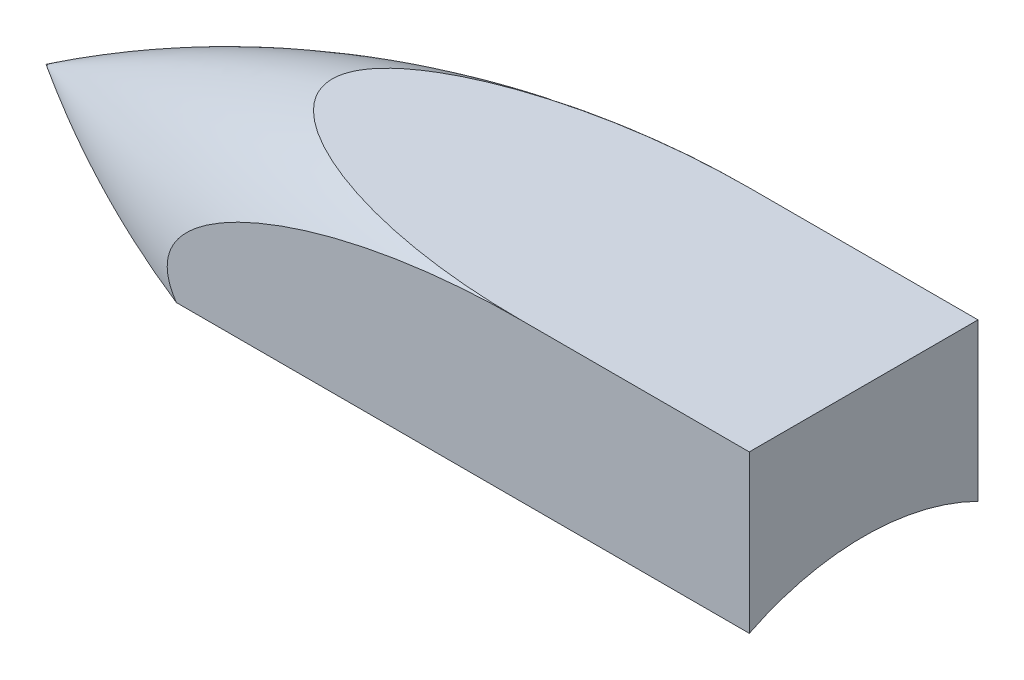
ISO-10303-21;
HEADER;
FILE_DESCRIPTION(('STEP AP214'),'2;1');
FILE_NAME('part.step','',(''),(''),'','','');
FILE_SCHEMA(('AUTOMOTIVE_DESIGN { 1 0 10303 214 1 1 1 1 }'));
ENDSEC;
DATA;
#1=APPLICATION_CONTEXT('core data for automotive mechanical design processes');
#2=APPLICATION_PROTOCOL_DEFINITION('international standard','automotive_design',2000,#1);
#3=PRODUCT_CONTEXT('',#1,'mechanical');
#4=PRODUCT('Part','Part','',(#3));
#5=PRODUCT_RELATED_PRODUCT_CATEGORY('part','',(#4));
#6=PRODUCT_DEFINITION_FORMATION('','',#4);
#7=PRODUCT_DEFINITION_CONTEXT('part definition',#1,'design');
#8=PRODUCT_DEFINITION('design','',#6,#7);
#9=PRODUCT_DEFINITION_SHAPE('','',#8);
#10=(LENGTH_UNIT() NAMED_UNIT(*) SI_UNIT(.MILLI.,.METRE.));
#11=(NAMED_UNIT(*) PLANE_ANGLE_UNIT() SI_UNIT($,.RADIAN.));
#12=(NAMED_UNIT(*) SI_UNIT($,.STERADIAN.) SOLID_ANGLE_UNIT());
#13=UNCERTAINTY_MEASURE_WITH_UNIT(LENGTH_MEASURE(1.E-05),#10,'distance_accuracy_value','');
#14=(GEOMETRIC_REPRESENTATION_CONTEXT(3) GLOBAL_UNCERTAINTY_ASSIGNED_CONTEXT((#13)) GLOBAL_UNIT_ASSIGNED_CONTEXT((#10,
#11,#12)) REPRESENTATION_CONTEXT('',''));
#15=CARTESIAN_POINT('',(0.,0.,0.));
#16=DIRECTION('',(0.,0.,1.));
#17=DIRECTION('',(1.,0.,0.));
#18=AXIS2_PLACEMENT_3D('',#15,#16,#17);
#19=CARTESIAN_POINT('',(25.4,0.,0.));
#20=DIRECTION('',(1.,0.,0.));
#21=DIRECTION('',(0.,0.,-1.));
#22=AXIS2_PLACEMENT_3D('',#19,#20,#21);
#23=PLANE('',#22);
#24=DIRECTION('',(0.,-1.,0.));
#25=VECTOR('',#24,1.);
#26=CARTESIAN_POINT('',(25.4,0.0451908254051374,-12.7));
#27=LINE('',#26,#25);
#28=CARTESIAN_POINT('',(25.4,14.478,-12.7));
#29=VERTEX_POINT('',#28);
#30=CARTESIAN_POINT('',(25.4,-2.9773316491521,-12.7));
#31=VERTEX_POINT('',#30);
#32=EDGE_CURVE('E108',#29,#31,#27,.T.);
#33=ORIENTED_EDGE('',*,*,#32,.F.);
#34=DIRECTION('',(0.,0.,1.));
#35=VECTOR('',#34,1.);
#36=CARTESIAN_POINT('',(25.4,14.478,-42.5605835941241));
#37=LINE('',#36,#35);
#38=CARTESIAN_POINT('',(25.4,14.478,12.7));
#39=VERTEX_POINT('',#38);
#40=EDGE_CURVE('E95',#29,#39,#37,.T.);
#41=ORIENTED_EDGE('',*,*,#40,.T.);
#42=DIRECTION('',(0.,-1.,0.));
#43=VECTOR('',#42,1.);
#44=CARTESIAN_POINT('',(25.4,0.0451908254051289,12.7));
#45=LINE('',#44,#43);
#46=CARTESIAN_POINT('',(25.4,-2.97733164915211,12.7));
#47=VERTEX_POINT('',#46);
#48=EDGE_CURVE('E106',#39,#47,#45,.T.);
#49=ORIENTED_EDGE('',*,*,#48,.T.);
#50=CARTESIAN_POINT('',(25.4,-28.575,0.));
#51=DIRECTION('',(1.,0.,0.));
#52=DIRECTION('',(0.,0.,-1.));
#53=AXIS2_PLACEMENT_3D('',#50,#51,#52);
#54=CIRCLE('',#53,28.575);
#55=EDGE_CURVE('E112',#31,#47,#54,.T.);
#56=ORIENTED_EDGE('',*,*,#55,.F.);
#57=EDGE_LOOP('',(#33,#41,#49,#56));
#58=FACE_BOUND('',#57,.T.);
#59=ADVANCED_FACE('F49',(#58),#23,.T.);
#60=CARTESIAN_POINT('',(0.,-101.446850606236,0.));
#61=DIRECTION('',(0.,0.,-1.));
#62=DIRECTION('',(0.,1.,0.));
#63=AXIS2_PLACEMENT_3D('',#60,#61,#62);
#64=CIRCLE('',#63,120.705679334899);
#65=TRIMMED_CURVE('',#64,(PARAMETER_VALUE(-0.57268684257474)),
(PARAMETER_VALUE(0.57268684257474)),.T.,.PARAMETER.);
#66=CARTESIAN_POINT('',(0.,0.,0.));
#67=DIRECTION('',(1.,0.,0.));
#68=AXIS1_PLACEMENT('',#66,#67);
#69=SURFACE_OF_REVOLUTION('',#65,#68);
#70=CARTESIAN_POINT('',(-33.5600579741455,6.99635018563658,12.7));
#71=CARTESIAN_POINT('',(-33.2930167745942,7.15653951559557,12.7));
#72=CARTESIAN_POINT('',(-33.0232036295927,7.31211219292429,12.7));
#73=CARTESIAN_POINT('',(-32.4789356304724,7.61493459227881,12.7));
#74=CARTESIAN_POINT('',(-32.2044803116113,7.76218347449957,12.7));
#75=CARTESIAN_POINT('',(-31.3750239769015,8.1927048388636,12.7));
#76=CARTESIAN_POINT('',(-30.8141177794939,8.46464268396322,12.7));
#77=CARTESIAN_POINT('',(-29.679703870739,8.98323875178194,12.7));
#78=CARTESIAN_POINT('',(-29.1061761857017,9.22985279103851,12.7));
#79=CARTESIAN_POINT('',(-27.9500538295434,9.70043063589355,12.7));
#80=CARTESIAN_POINT('',(-27.3674607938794,9.92439847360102,12.7));
#81=CARTESIAN_POINT('',(-26.1902365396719,10.3537567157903,12.7));
#82=CARTESIAN_POINT('',(-25.5955463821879,10.5589848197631,12.7));
#83=CARTESIAN_POINT('',(-24.3999953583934,10.9506016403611,12.7));
#84=CARTESIAN_POINT('',(-23.7991343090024,11.1369897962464,12.7));
#85=CARTESIAN_POINT('',(-22.5928017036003,11.4920966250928,12.7));
#86=CARTESIAN_POINT('',(-21.9873346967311,11.6608307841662,12.7));
#87=CARTESIAN_POINT('',(-20.7720418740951,11.9818362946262,12.7));
#88=CARTESIAN_POINT('',(-20.1622158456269,12.1341068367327,12.7));
#89=CARTESIAN_POINT('',(-18.4028599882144,12.5495781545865,12.7));
#90=CARTESIAN_POINT('',(-17.2486303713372,12.7930711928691,12.7));
#91=CARTESIAN_POINT('',(-14.9304626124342,13.228751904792,12.7));
#92=CARTESIAN_POINT('',(-13.7665230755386,13.4209320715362,12.7));
#93=CARTESIAN_POINT('',(-11.4305728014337,13.7564963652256,12.7));
#94=CARTESIAN_POINT('',(-10.2585557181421,13.8998362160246,12.7));
#95=CARTESIAN_POINT('',(-7.90977060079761,14.1390237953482,12.7));
#96=CARTESIAN_POINT('',(-6.73300281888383,14.2348740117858,12.7));
#97=CARTESIAN_POINT('',(-4.37972435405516,14.3798332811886,12.7));
#98=CARTESIAN_POINT('',(-3.20322121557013,14.4290652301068,12.7));
#99=CARTESIAN_POINT('',(-0.849156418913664,14.4816729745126,12.7));
#100=CARTESIAN_POINT('',(0.328405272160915,14.485047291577,12.7));
#101=CARTESIAN_POINT('',(2.68202259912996,14.4459786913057,12.7));
#102=CARTESIAN_POINT('',(3.85807871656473,14.4035649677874,12.7));
#103=CARTESIAN_POINT('',(6.20752309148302,14.2725880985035,12.7));
#104=CARTESIAN_POINT('',(7.3809115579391,14.1840287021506,12.7));
#105=CARTESIAN_POINT('',(9.9168113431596,13.941402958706,12.7));
#106=CARTESIAN_POINT('',(11.2785270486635,13.7789288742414,12.7));
#107=CARTESIAN_POINT('',(13.9926333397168,13.3878436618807,12.7));
#108=CARTESIAN_POINT('',(15.3450233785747,13.159228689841,12.7));
#109=CARTESIAN_POINT('',(17.3611402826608,12.764143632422,12.7));
#110=CARTESIAN_POINT('',(18.0301023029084,12.6240051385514,12.7));
#111=CARTESIAN_POINT('',(19.3639515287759,12.3255667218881,12.7));
#112=CARTESIAN_POINT('',(20.0288389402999,12.167267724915,12.7));
#113=CARTESIAN_POINT('',(21.353606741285,11.8316364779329,12.7));
#114=CARTESIAN_POINT('',(22.0134884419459,11.6543094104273,12.7));
#115=CARTESIAN_POINT('',(23.3274366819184,11.2793952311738,12.7));
#116=CARTESIAN_POINT('',(23.9815036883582,11.0818097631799,12.7));
#117=CARTESIAN_POINT('',(25.1964712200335,10.6923881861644,12.7));
#118=CARTESIAN_POINT('',(25.7582377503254,10.5032565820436,12.7));
#119=CARTESIAN_POINT('',(26.8754756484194,10.107143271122,12.7));
#120=CARTESIAN_POINT('',(27.4309469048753,9.90016124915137,12.7));
#121=CARTESIAN_POINT('',(28.5366108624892,9.46558365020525,12.7));
#122=CARTESIAN_POINT('',(29.0867698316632,9.23790183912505,12.7));
#123=CARTESIAN_POINT('',(30.1772339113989,8.76026723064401,12.7));
#124=CARTESIAN_POINT('',(30.7175410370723,8.51031905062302,12.7));
#125=CARTESIAN_POINT('',(31.7917862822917,7.98165041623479,12.7));
#126=CARTESIAN_POINT('',(32.3255795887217,7.70263199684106,12.7));
#127=CARTESIAN_POINT('',(33.1133475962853,7.26040067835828,12.7));
#128=CARTESIAN_POINT('',(33.3739398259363,7.10893899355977,12.7));
#129=CARTESIAN_POINT('',(33.8898343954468,6.79728118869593,12.7));
#130=CARTESIAN_POINT('',(34.1451373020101,6.63708601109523,12.7));
#131=CARTESIAN_POINT('',(34.6478618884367,6.30791969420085,12.7));
#132=CARTESIAN_POINT('',(34.8953216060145,6.13900684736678,12.7));
#133=CARTESIAN_POINT('',(35.382536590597,5.79026129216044,12.7));
#134=CARTESIAN_POINT('',(35.6222903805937,5.61042650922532,12.7));
#135=CARTESIAN_POINT('',(36.0915424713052,5.23876048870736,12.7));
#136=CARTESIAN_POINT('',(36.3210612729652,5.04695526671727,12.7));
#137=CARTESIAN_POINT('',(36.767507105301,4.64930288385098,12.7));
#138=CARTESIAN_POINT('',(36.9844412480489,4.44346379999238,12.7));
#139=CARTESIAN_POINT('',(37.3331052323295,4.08605089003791,12.7));
#140=CARTESIAN_POINT('',(37.4693792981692,3.93891364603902,12.7));
#141=CARTESIAN_POINT('',(37.7328925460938,3.63667146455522,12.7));
#142=CARTESIAN_POINT('',(37.8601303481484,3.48156531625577,12.7));
#143=CARTESIAN_POINT('',(38.1032716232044,3.16306344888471,12.7));
#144=CARTESIAN_POINT('',(38.219194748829,2.99968287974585,12.7));
#145=CARTESIAN_POINT('',(38.4373094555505,2.66409719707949,12.7));
#146=CARTESIAN_POINT('',(38.5395069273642,2.49189591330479,12.7));
#147=CARTESIAN_POINT('',(38.7637660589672,2.06935036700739,12.7));
#148=CARTESIAN_POINT('',(38.8780557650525,1.81469847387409,12.7));
#149=CARTESIAN_POINT('',(39.0178818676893,1.42170059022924,12.7));
#150=CARTESIAN_POINT('',(39.0592211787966,1.28887173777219,12.7));
#151=CARTESIAN_POINT('',(39.1302740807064,1.02016449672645,12.7));
#152=CARTESIAN_POINT('',(39.1599935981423,0.884287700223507,12.7));
#153=CARTESIAN_POINT('',(39.2070937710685,0.609104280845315,12.7));
#154=CARTESIAN_POINT('',(39.2243577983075,0.469777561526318,12.7));
#155=CARTESIAN_POINT('',(39.2454893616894,0.190105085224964,12.7));
#156=CARTESIAN_POINT('',(39.2493571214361,0.0497593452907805,12.7));
#157=CARTESIAN_POINT('',(39.2435466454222,-0.230663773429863,12.7));
#158=CARTESIAN_POINT('',(39.2338675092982,-0.37074113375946,12.7));
#159=CARTESIAN_POINT('',(39.2013369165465,-0.649317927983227,12.7));
#160=CARTESIAN_POINT('',(39.1784856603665,-0.787817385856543,12.7));
#161=CARTESIAN_POINT('',(39.0978311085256,-1.16834741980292,12.7));
#162=CARTESIAN_POINT('',(39.0266642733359,-1.4076215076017,12.7));
#163=CARTESIAN_POINT('',(38.851564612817,-1.87359120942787,12.7));
#164=CARTESIAN_POINT('',(38.7476160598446,-2.10028072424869,12.7));
#165=CARTESIAN_POINT('',(38.5273403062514,-2.51436538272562,12.7));
#166=CARTESIAN_POINT('',(38.4138166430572,-2.70327953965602,12.7));
#167=CARTESIAN_POINT('',(38.1705373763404,-3.07043941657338,12.7));
#168=CARTESIAN_POINT('',(38.0407701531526,-3.24867736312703,12.7));
#169=CARTESIAN_POINT('',(37.7680265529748,-3.59543651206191,12.7));
#170=CARTESIAN_POINT('',(37.6250151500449,-3.76392991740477,12.7));
#171=CARTESIAN_POINT('',(37.3286139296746,-4.09158975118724,12.7));
#172=CARTESIAN_POINT('',(37.1752197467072,-4.25075220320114,12.7));
#173=CARTESIAN_POINT('',(36.8550179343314,-4.56554425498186,12.7));
#174=CARTESIAN_POINT('',(36.6879373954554,-4.7208949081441,12.7));
#175=CARTESIAN_POINT('',(36.3465804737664,-5.02338342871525,12.7));
#176=CARTESIAN_POINT('',(36.1723049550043,-5.17052227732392,12.7));
#177=CARTESIAN_POINT('',(35.6402511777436,-5.60119592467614,12.7));
#178=CARTESIAN_POINT('',(35.2735360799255,-5.87371011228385,12.7));
#179=CARTESIAN_POINT('',(34.5226892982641,-6.39508342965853,12.7));
#180=CARTESIAN_POINT('',(34.1385203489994,-6.64388805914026,12.7));
#181=CARTESIAN_POINT('',(33.5530658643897,-7.00169111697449,12.7));
#182=CARTESIAN_POINT('',(33.3564201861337,-7.11837019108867,12.7));
#183=CARTESIAN_POINT('',(32.9603913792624,-7.34700209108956,12.7));
#184=CARTESIAN_POINT('',(32.7610081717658,-7.45895478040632,12.7));
#185=CARTESIAN_POINT('',(32.2476759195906,-7.73985309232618,12.7));
#186=CARTESIAN_POINT('',(31.9320081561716,-7.9056620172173,12.7));
#187=CARTESIAN_POINT('',(31.2958008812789,-8.22767859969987,12.7));
#188=CARTESIAN_POINT('',(30.97526088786,-8.38388529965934,12.7));
#189=CARTESIAN_POINT('',(30.0072750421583,-8.83951823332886,12.7));
#190=CARTESIAN_POINT('',(29.3536445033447,-9.12585973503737,12.7));
#191=CARTESIAN_POINT('',(28.0331398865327,-9.66915199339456,12.7));
#192=CARTESIAN_POINT('',(27.3662454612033,-9.92605272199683,12.7));
#193=CARTESIAN_POINT('',(26.0230060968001,-10.4133717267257,12.7));
#194=CARTESIAN_POINT('',(25.346662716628,-10.6437943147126,12.7));
#195=CARTESIAN_POINT('',(23.9838607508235,-11.0814878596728,12.7));
#196=CARTESIAN_POINT('',(23.2973744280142,-11.2886720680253,12.7));
#197=CARTESIAN_POINT('',(21.9180722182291,-11.6807694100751,12.7));
#198=CARTESIAN_POINT('',(21.2252561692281,-11.8656819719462,12.7));
#199=CARTESIAN_POINT('',(19.8349858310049,-12.2144525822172,12.7));
#200=CARTESIAN_POINT('',(19.1375360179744,-12.3783285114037,12.7));
#201=CARTESIAN_POINT('',(17.7382607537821,-12.686243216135,12.7));
#202=CARTESIAN_POINT('',(17.0364351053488,-12.8302810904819,12.7));
#203=CARTESIAN_POINT('',(15.1271582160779,-13.1952934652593,12.7));
#204=CARTESIAN_POINT('',(13.9161483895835,-13.3978563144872,12.7));
#205=CARTESIAN_POINT('',(11.4863800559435,-13.7499332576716,12.7));
#206=CARTESIAN_POINT('',(10.2676206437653,-13.8994410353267,12.7));
#207=CARTESIAN_POINT('',(7.82385433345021,-14.1472280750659,12.7));
#208=CARTESIAN_POINT('',(6.59884296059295,-14.2454631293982,12.7));
#209=CARTESIAN_POINT('',(4.14588947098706,-14.3915387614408,12.7));
#210=CARTESIAN_POINT('',(2.91794748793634,-14.4393815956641,12.7));
#211=CARTESIAN_POINT('',(0.462781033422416,-14.4851207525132,12.7));
#212=CARTESIAN_POINT('',(-0.764442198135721,-14.4830838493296,12.7));
#213=CARTESIAN_POINT('',(-3.21785111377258,-14.4292070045,12.7));
#214=CARTESIAN_POINT('',(-4.44403675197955,-14.3773649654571,12.7));
#215=CARTESIAN_POINT('',(-6.89236712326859,-14.2234195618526,12.7));
#216=CARTESIAN_POINT('',(-8.11451414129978,-14.1213526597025,12.7));
#217=CARTESIAN_POINT('',(-10.5533177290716,-13.865914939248,12.7));
#218=CARTESIAN_POINT('',(-11.769974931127,-13.712550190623,12.7));
#219=CARTESIAN_POINT('',(-14.188349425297,-13.3537538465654,12.7));
#220=CARTESIAN_POINT('',(-15.3901124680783,-13.1486312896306,12.7));
#221=CARTESIAN_POINT('',(-17.783082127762,-12.6830733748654,12.7));
#222=CARTESIAN_POINT('',(-18.9742881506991,-12.4226349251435,12.7));
#223=CARTESIAN_POINT('',(-20.7474335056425,-11.9878241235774,12.7));
#224=CARTESIAN_POINT('',(-21.3349386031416,-11.8359072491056,12.7));
#225=CARTESIAN_POINT('',(-22.5056801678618,-11.516467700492,12.7));
#226=CARTESIAN_POINT('',(-23.0889168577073,-11.348945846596,12.7));
#227=CARTESIAN_POINT('',(-24.25019814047,-10.9973673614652,12.7));
#228=CARTESIAN_POINT('',(-24.8282442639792,-10.8133157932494,12.7));
#229=CARTESIAN_POINT('',(-25.9783186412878,-10.4273728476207,12.7));
#230=CARTESIAN_POINT('',(-26.550347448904,-10.2254831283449,12.7));
#231=CARTESIAN_POINT('',(-27.5563333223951,-9.85087592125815,12.7));
#232=CARTESIAN_POINT('',(-27.9917723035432,-9.68213604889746,12.7));
#233=CARTESIAN_POINT('',(-28.8575897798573,-9.33206883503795,12.7));
#234=CARTESIAN_POINT('',(-29.2879681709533,-9.15074123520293,12.7));
#235=CARTESIAN_POINT('',(-30.1454351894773,-8.77301353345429,12.7));
#236=CARTESIAN_POINT('',(-30.572483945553,-8.57652268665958,12.7));
#237=CARTESIAN_POINT('',(-31.4189718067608,-8.16789477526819,12.7));
#238=CARTESIAN_POINT('',(-31.8384124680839,-7.95576095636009,12.7));
#239=CARTESIAN_POINT('',(-32.5115547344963,-7.59691159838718,12.7));
#240=CARTESIAN_POINT('',(-32.7681711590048,-7.4556549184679,12.7));
#241=CARTESIAN_POINT('',(-33.2770551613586,-7.16552622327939,12.7));
#242=CARTESIAN_POINT('',(-33.5293230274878,-7.01665471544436,12.7));
#243=CARTESIAN_POINT('',(-34.0291347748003,-6.7102250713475,12.7));
#244=CARTESIAN_POINT('',(-34.2766698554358,-6.55265253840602,12.7));
#245=CARTESIAN_POINT('',(-34.7654828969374,-6.22807875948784,12.7));
#246=CARTESIAN_POINT('',(-35.0067612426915,-6.06107809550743,12.7));
#247=CARTESIAN_POINT('',(-35.4794119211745,-5.71806073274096,12.7));
#248=CARTESIAN_POINT('',(-35.7108559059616,-5.54214321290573,12.7));
#249=CARTESIAN_POINT('',(-36.16437132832,-5.17841333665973,12.7));
#250=CARTESIAN_POINT('',(-36.3864400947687,-4.99059762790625,12.7));
#251=CARTESIAN_POINT('',(-36.8177869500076,-4.6020684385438,12.7));
#252=CARTESIAN_POINT('',(-37.027103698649,-4.40139815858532,12.7));
#253=CARTESIAN_POINT('',(-37.4298874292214,-3.98485486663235,12.7));
#254=CARTESIAN_POINT('',(-37.6233676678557,-3.76899485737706,12.7));
#255=CARTESIAN_POINT('',(-37.9167322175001,-3.40905716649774,12.7));
#256=CARTESIAN_POINT('',(-38.0233124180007,-3.27044936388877,12.7));
#257=CARTESIAN_POINT('',(-38.2272576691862,-2.98662274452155,12.7));
#258=CARTESIAN_POINT('',(-38.3246212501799,-2.84140287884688,12.7));
#259=CARTESIAN_POINT('',(-38.5998155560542,-2.39591233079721,12.7));
#260=CARTESIAN_POINT('',(-38.7614158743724,-2.08502252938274,12.7));
#261=CARTESIAN_POINT('',(-38.9900575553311,-1.51852905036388,12.7));
#262=CARTESIAN_POINT('',(-39.0706242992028,-1.26843165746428,12.7));
#263=CARTESIAN_POINT('',(-39.1889823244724,-0.758214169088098,12.7));
#264=CARTESIAN_POINT('',(-39.2268139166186,-0.498103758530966,12.7));
#265=CARTESIAN_POINT('',(-39.2551898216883,0.0257551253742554,12.7));
#266=CARTESIAN_POINT('',(-39.2455546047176,0.289513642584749,12.7));
#267=CARTESIAN_POINT('',(-39.1798642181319,0.811138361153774,12.7));
#268=CARTESIAN_POINT('',(-39.1237784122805,1.0690005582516,12.7));
#269=CARTESIAN_POINT('',(-38.9528196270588,1.63412004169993,12.7));
#270=CARTESIAN_POINT('',(-38.8269003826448,1.93797642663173,12.7));
#271=CARTESIAN_POINT('',(-38.5284788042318,2.52198713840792,12.7));
#272=CARTESIAN_POINT('',(-38.3558519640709,2.80207544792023,12.7));
#273=CARTESIAN_POINT('',(-38.0033897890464,3.30197532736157,12.7));
#274=CARTESIAN_POINT('',(-37.827731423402,3.52480293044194,12.7));
#275=CARTESIAN_POINT('',(-37.4578355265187,3.95462360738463,12.7));
#276=CARTESIAN_POINT('',(-37.2635826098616,4.16160330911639,12.7));
#277=CARTESIAN_POINT('',(-36.8607944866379,4.56169376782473,12.7));
#278=CARTESIAN_POINT('',(-36.6522366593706,4.75478152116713,12.7));
#279=CARTESIAN_POINT('',(-36.2243564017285,5.12841553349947,12.7));
#280=CARTESIAN_POINT('',(-36.0050373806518,5.30896572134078,12.7));
#281=CARTESIAN_POINT('',(-35.6048069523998,5.62232022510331,12.7));
#282=CARTESIAN_POINT('',(-35.4254999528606,5.7571899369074,12.7));
#283=CARTESIAN_POINT('',(-35.0623859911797,6.02070586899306,12.7));
#284=CARTESIAN_POINT('',(-34.878579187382,6.1493523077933,12.7));
#285=CARTESIAN_POINT('',(-34.5075289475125,6.40070331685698,12.7));
#286=CARTESIAN_POINT('',(-34.320293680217,6.52341997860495,12.7));
#287=CARTESIAN_POINT('',(-33.9425356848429,6.76366962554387,12.7));
#288=CARTESIAN_POINT('',(-33.7520129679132,6.88120262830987,12.7));
#289=CARTESIAN_POINT('',(-33.5600579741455,6.99635018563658,12.7));
#290=B_SPLINE_CURVE_WITH_KNOTS('',3,(#70,#71,#72,#73,#74,#75,#76,#77,#78,#79,#80,#81,#82,#83,
#84,#85,#86,#87,#88,#89,#90,#91,#92,#93,#94,#95,#96,#97,#98,#99,#100,#101,#102,#103,#104,#105,
#106,#107,#108,#109,#110,#111,#112,#113,#114,#115,#116,#117,#118,#119,#120,#121,#122,#123,#124,
#125,#126,#127,#128,#129,#130,#131,#132,#133,#134,#135,#136,#137,#138,#139,#140,#141,#142,#143,
#144,#145,#146,#147,#148,#149,#150,#151,#152,#153,#154,#155,#156,#157,#158,#159,#160,#161,#162,
#163,#164,#165,#166,#167,#168,#169,#170,#171,#172,#173,#174,#175,#176,#177,#178,#179,#180,#181,
#182,#183,#184,#185,#186,#187,#188,#189,#190,#191,#192,#193,#194,#195,#196,#197,#198,#199,#200,
#201,#202,#203,#204,#205,#206,#207,#208,#209,#210,#211,#212,#213,#214,#215,#216,#217,#218,#219,
#220,#221,#222,#223,#224,#225,#226,#227,#228,#229,#230,#231,#232,#233,#234,#235,#236,#237,#238,
#239,#240,#241,#242,#243,#244,#245,#246,#247,#248,#249,#250,#251,#252,#253,#254,#255,#256,#257,
#258,#259,#260,#261,#262,#263,#264,#265,#266,#267,#268,#269,#270,#271,#272,#273,#274,#275,#276,
#277,#278,#279,#280,#281,#282,#283,#284,#285,#286,#287,#288,#289),.UNSPECIFIED.,.T.,.F.,(4,2,2,
2,2,2,2,2,2,2,2,2,2,2,2,2,2,2,2,2,2,2,2,2,2,2,2,2,2,2,2,2,2,2,2,2,2,2,2,2,2,2,2,2,2,2,2,2,2,2,2,
2,2,2,2,2,2,2,2,2,2,2,2,2,2,2,2,2,2,2,2,2,2,2,2,2,2,2,2,2,2,2,2,2,2,2,2,2,2,2,2,2,2,2,2,2,2,2,2,
2,2,2,2,2,2,2,2,2,2,4),(0.,0.934175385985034,1.86844485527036,3.7376280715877,5.61001901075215,
7.48207598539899,9.36905424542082,11.256088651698,13.1414536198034,15.0269112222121,
18.564439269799,22.1024845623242,25.6437287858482,29.184787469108,32.7164849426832,
36.2482962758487,39.7778571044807,43.3071311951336,47.4197205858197,51.5325490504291,
53.5827922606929,55.6329309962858,57.6825127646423,59.7319283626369,61.5099091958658,
63.2879214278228,65.0737135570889,66.8591362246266,68.6651020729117,69.5691996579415,
70.4731998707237,71.3717870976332,72.2705455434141,73.1674144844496,74.0637715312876,
74.6651208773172,75.2665618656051,75.8669388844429,76.4670574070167,77.3009688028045,
77.7178816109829,78.1345814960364,78.5551342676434,78.9756800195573,79.3962537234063,
79.8168210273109,80.5625955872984,81.3087284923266,81.9689477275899,82.629641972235,
83.292136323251,83.954910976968,84.6390348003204,85.3230767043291,86.6923617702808,
88.0647220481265,88.7506341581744,89.4365660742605,90.5060612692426,91.5756629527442,
93.7154827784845,95.858886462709,98.0019406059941,100.152745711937,102.303606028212,
104.452625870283,106.601743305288,110.283901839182,113.9664985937,117.652265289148,
121.337866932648,125.018534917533,128.699357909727,132.377512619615,136.055232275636,
139.711491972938,143.367956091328,145.188268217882,147.008484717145,148.828145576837,
150.647637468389,152.048438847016,153.449268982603,154.859252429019,156.268944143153,
157.147612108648,158.026221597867,158.906331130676,159.786386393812,160.658192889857,
161.530246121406,162.399508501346,163.268035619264,163.792229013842,164.316505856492,
165.361988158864,166.147176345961,166.931623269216,167.719039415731,168.5069753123,
169.488206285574,170.472079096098,171.322077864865,172.172786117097,173.024872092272,
173.876689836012,174.549656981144,175.222600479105,175.894108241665,176.56561372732),.UNSPECIFIED.);
#291=CARTESIAN_POINT('',(-38.2312823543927,-2.97733164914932,12.6999999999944));
#292=VERTEX_POINT('',#291);
#293=CARTESIAN_POINT('',(0.,14.478,12.7));
#294=VERTEX_POINT('',#293);
#295=EDGE_CURVE('E59',#292,#294,#290,.T.);
#296=ORIENTED_EDGE('',*,*,#295,.T.);
#297=CARTESIAN_POINT('',(-33.6346552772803,14.478,0.));
#298=CARTESIAN_POINT('',(-33.6346476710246,14.478,-0.268011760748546));
#299=CARTESIAN_POINT('',(-33.6086819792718,14.478,-0.536044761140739));
#300=CARTESIAN_POINT('',(-33.5083865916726,14.478,-1.06298168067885));
#301=CARTESIAN_POINT('',(-33.433980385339,14.478,-1.32187047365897));
#302=CARTESIAN_POINT('',(-33.2195610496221,14.478,-1.89241187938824));
#303=CARTESIAN_POINT('',(-33.0672323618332,14.478,-2.19934853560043));
#304=CARTESIAN_POINT('',(-32.7163474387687,14.478,-2.78536351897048));
#305=CARTESIAN_POINT('',(-32.5176899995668,14.478,-3.06437891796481));
#306=CARTESIAN_POINT('',(-32.1129326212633,14.478,-3.56584718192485));
#307=CARTESIAN_POINT('',(-31.9102541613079,14.478,-3.79112325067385));
#308=CARTESIAN_POINT('',(-31.4863304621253,14.478,-4.22364028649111));
#309=CARTESIAN_POINT('',(-31.2650697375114,14.478,-4.43086591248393));
#310=CARTESIAN_POINT('',(-30.8082197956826,14.478,-4.82992030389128));
#311=CARTESIAN_POINT('',(-30.5725959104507,14.478,-5.02170899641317));
#312=CARTESIAN_POINT('',(-30.0908264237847,14.478,-5.39130854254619));
#313=CARTESIAN_POINT('',(-29.8446841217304,14.478,-5.56912373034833));
#314=CARTESIAN_POINT('',(-29.2373383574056,14.478,-5.98583919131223));
#315=CARTESIAN_POINT('',(-28.871829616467,14.478,-6.21845255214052));
#316=CARTESIAN_POINT('',(-28.128315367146,14.478,-6.66291900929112));
#317=CARTESIAN_POINT('',(-27.7503042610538,14.478,-6.87476263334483));
#318=CARTESIAN_POINT('',(-26.9841783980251,14.478,-7.28084787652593));
#319=CARTESIAN_POINT('',(-26.5960477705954,14.478,-7.47505940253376));
#320=CARTESIAN_POINT('',(-25.8123851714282,14.478,-7.84767543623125));
#321=CARTESIAN_POINT('',(-25.4168543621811,14.478,-8.02608240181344));
#322=CARTESIAN_POINT('',(-24.618304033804,14.478,-8.36946440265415));
#323=CARTESIAN_POINT('',(-24.2152623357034,14.478,-8.53438766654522));
#324=CARTESIAN_POINT('',(-23.4041765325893,14.478,-8.85141966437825));
#325=CARTESIAN_POINT('',(-22.9961323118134,14.478,-9.00352810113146));
#326=CARTESIAN_POINT('',(-22.1762291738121,14.478,-9.2958640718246));
#327=CARTESIAN_POINT('',(-21.7643739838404,14.478,-9.43610208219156));
#328=CARTESIAN_POINT('',(-20.9371088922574,14.478,-9.70569686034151));
#329=CARTESIAN_POINT('',(-20.5216987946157,14.478,-9.83505302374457));
#330=CARTESIAN_POINT('',(-19.233456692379,14.478,-10.2190341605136));
#331=CARTESIAN_POINT('',(-18.3554834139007,14.478,-10.4565490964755));
#332=CARTESIAN_POINT('',(-16.589689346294,14.478,-10.8918487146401));
#333=CARTESIAN_POINT('',(-15.7018667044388,14.478,-11.0896257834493));
#334=CARTESIAN_POINT('',(-13.9179519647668,14.478,-11.4486924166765));
#335=CARTESIAN_POINT('',(-13.0218523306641,14.478,-11.6099444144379));
#336=CARTESIAN_POINT('',(-11.2242007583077,14.478,-11.8978475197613));
#337=CARTESIAN_POINT('',(-10.3226491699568,14.478,-12.0245008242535));
#338=CARTESIAN_POINT('',(-8.51305924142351,14.478,-12.2450009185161));
#339=CARTESIAN_POINT('',(-7.60500990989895,14.478,-12.3387571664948));
#340=CARTESIAN_POINT('',(-5.78615512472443,14.478,-12.4939778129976));
#341=CARTESIAN_POINT('',(-4.87534963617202,14.478,-12.5554418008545));
#342=CARTESIAN_POINT('',(-3.05276360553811,14.478,-12.6466536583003));
#343=CARTESIAN_POINT('',(-2.14098411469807,14.478,-12.6764225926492));
#344=CARTESIAN_POINT('',(-0.316938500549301,14.478,-12.7045982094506));
#345=CARTESIAN_POINT('',(0.595327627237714,14.478,-12.7030045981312));
#346=CARTESIAN_POINT('',(2.50605187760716,14.478,-12.6667979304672));
#347=CARTESIAN_POINT('',(3.50445267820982,14.478,-12.6290577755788));
#348=CARTESIAN_POINT('',(5.49911734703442,14.478,-12.5155190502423));
#349=CARTESIAN_POINT('',(6.49538114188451,14.478,-12.4397191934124));
#350=CARTESIAN_POINT('',(8.48554848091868,14.478,-12.2490225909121));
#351=CARTESIAN_POINT('',(9.4794471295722,14.478,-12.134074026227));
#352=CARTESIAN_POINT('',(10.966038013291,14.478,-11.9312163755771));
#353=CARTESIAN_POINT('',(11.4608431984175,14.478,-11.858527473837));
#354=CARTESIAN_POINT('',(12.4488676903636,14.478,-11.7027181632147));
#355=CARTESIAN_POINT('',(12.9420868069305,14.478,-11.6195965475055));
#356=CARTESIAN_POINT('',(14.4110368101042,14.478,-11.3555408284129));
#357=CARTESIAN_POINT('',(15.383987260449,14.478,-11.1588435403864));
#358=CARTESIAN_POINT('',(17.3195496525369,14.478,-10.7198677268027));
#359=CARTESIAN_POINT('',(18.2821627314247,14.478,-10.4775942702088));
#360=CARTESIAN_POINT('',(19.7143958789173,14.478,-10.0763662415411));
#361=CARTESIAN_POINT('',(20.189397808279,14.478,-9.93647667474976));
#362=CARTESIAN_POINT('',(21.1351801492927,14.478,-9.6431235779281));
#363=CARTESIAN_POINT('',(21.6059608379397,14.478,-9.48966094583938));
#364=CARTESIAN_POINT('',(22.5422444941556,14.478,-9.16811826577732));
#365=CARTESIAN_POINT('',(23.0077500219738,14.478,-9.00004568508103));
#366=CARTESIAN_POINT('',(23.9325977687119,14.478,-8.64778791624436));
#367=CARTESIAN_POINT('',(24.3919408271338,14.478,-8.46360494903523));
#368=CARTESIAN_POINT('',(25.0321594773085,14.478,-8.19208756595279));
#369=CARTESIAN_POINT('',(25.2162411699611,14.478,-8.11227118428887));
#370=CARTESIAN_POINT('',(25.5830144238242,14.478,-7.94951844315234));
#371=CARTESIAN_POINT('',(25.7657060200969,14.478,-7.86658216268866));
#372=CARTESIAN_POINT('',(26.3115197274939,14.478,-7.61283031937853));
#373=CARTESIAN_POINT('',(26.6723688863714,14.478,-7.43707676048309));
#374=CARTESIAN_POINT('',(27.3872656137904,14.478,-7.0703931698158));
#375=CARTESIAN_POINT('',(27.741297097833,14.478,-6.87943167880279));
#376=CARTESIAN_POINT('',(28.4396757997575,14.478,-6.48054682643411));
#377=CARTESIAN_POINT('',(28.7840245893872,14.478,-6.27262623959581));
#378=CARTESIAN_POINT('',(29.4051658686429,14.478,-5.87238723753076));
#379=CARTESIAN_POINT('',(29.683850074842,14.478,-5.68301592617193));
#380=CARTESIAN_POINT('',(30.2298659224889,14.478,-5.28821292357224));
#381=CARTESIAN_POINT('',(30.4971930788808,14.478,-5.08277497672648));
#382=CARTESIAN_POINT('',(31.0156421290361,14.478,-4.65412534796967));
#383=CARTESIAN_POINT('',(31.2668212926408,14.478,-4.43098355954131));
#384=CARTESIAN_POINT('',(31.7482969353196,14.478,-3.96338851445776));
#385=CARTESIAN_POINT('',(31.9786169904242,14.478,-3.71895994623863));
#386=CARTESIAN_POINT('',(32.3874736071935,14.478,-3.23246673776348));
#387=CARTESIAN_POINT('',(32.5689092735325,14.478,-2.99286510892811));
#388=CARTESIAN_POINT('',(32.8998264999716,14.478,-2.49180260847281));
#389=CARTESIAN_POINT('',(33.0493036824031,14.478,-2.2303387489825));
#390=CARTESIAN_POINT('',(33.2414442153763,14.478,-1.82063736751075));
#391=CARTESIAN_POINT('',(33.3004694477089,14.478,-1.68001021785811));
#392=CARTESIAN_POINT('',(33.4054783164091,14.478,-1.39400114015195));
#393=CARTESIAN_POINT('',(33.4514698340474,14.478,-1.24862214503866));
#394=CARTESIAN_POINT('',(33.528774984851,14.478,-0.954279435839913));
#395=CARTESIAN_POINT('',(33.5601165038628,14.478,-0.805323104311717));
#396=CARTESIAN_POINT('',(33.6069886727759,14.478,-0.504940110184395));
#397=CARTESIAN_POINT('',(33.6225225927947,14.478,-0.353513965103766));
#398=CARTESIAN_POINT('',(33.6361490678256,14.478,-0.0697477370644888));
#399=CARTESIAN_POINT('',(33.6362575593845,14.478,0.0624975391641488));
#400=CARTESIAN_POINT('',(33.6240504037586,14.478,0.326428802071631));
#401=CARTESIAN_POINT('',(33.6117307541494,14.478,0.458114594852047));
#402=CARTESIAN_POINT('',(33.556598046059,14.478,0.850731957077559));
#403=CARTESIAN_POINT('',(33.4956128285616,14.478,1.10926014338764));
#404=CARTESIAN_POINT('',(33.3155172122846,14.478,1.66393405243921));
#405=CARTESIAN_POINT('',(33.1870647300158,14.478,1.95694872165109));
#406=CARTESIAN_POINT('',(32.8854777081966,14.478,2.51893640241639));
#407=CARTESIAN_POINT('',(32.7122543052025,14.478,2.78786015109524));
#408=CARTESIAN_POINT('',(32.3612882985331,14.478,3.26497795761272));
#409=CARTESIAN_POINT('',(32.1877614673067,14.478,3.47634891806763));
#410=CARTESIAN_POINT('',(31.8230904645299,14.478,3.88345116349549));
#411=CARTESIAN_POINT('',(31.6319326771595,14.478,4.07917013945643));
#412=CARTESIAN_POINT('',(31.2358382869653,14.478,4.45701449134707));
#413=CARTESIAN_POINT('',(31.0308685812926,14.478,4.63910482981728));
#414=CARTESIAN_POINT('',(30.610634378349,14.478,4.99077369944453));
#415=CARTESIAN_POINT('',(30.3953727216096,14.478,5.16035565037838));
#416=CARTESIAN_POINT('',(29.873603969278,14.478,5.55067546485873));
#417=CARTESIAN_POINT('',(29.5634082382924,14.478,5.76647157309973));
#418=CARTESIAN_POINT('',(28.9313412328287,14.478,6.1803508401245));
#419=CARTESIAN_POINT('',(28.609464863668,14.478,6.3784261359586));
#420=CARTESIAN_POINT('',(27.9562363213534,14.478,6.75948596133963));
#421=CARTESIAN_POINT('',(27.6248694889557,14.478,6.94244523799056));
#422=CARTESIAN_POINT('',(26.9550811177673,14.478,7.2947616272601));
#423=CARTESIAN_POINT('',(26.6166606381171,14.478,7.46412076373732));
#424=CARTESIAN_POINT('',(25.9326311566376,14.478,7.79142802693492));
#425=CARTESIAN_POINT('',(25.5869980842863,14.478,7.94932568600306));
#426=CARTESIAN_POINT('',(24.8909229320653,14.478,8.25410535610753));
#427=CARTESIAN_POINT('',(24.5404807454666,14.478,8.40098712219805));
#428=CARTESIAN_POINT('',(23.4837342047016,14.478,8.82633799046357));
#429=CARTESIAN_POINT('',(22.7713680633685,14.478,9.08981440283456));
#430=CARTESIAN_POINT('',(21.2841553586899,14.478,9.59975546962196));
#431=CARTESIAN_POINT('',(20.508454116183,14.478,9.84369766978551));
#432=CARTESIAN_POINT('',(18.9468330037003,14.478,10.2967556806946));
#433=CARTESIAN_POINT('',(18.1609110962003,14.478,10.5058644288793));
#434=CARTESIAN_POINT('',(16.5805686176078,14.478,10.8925617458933));
#435=CARTESIAN_POINT('',(15.7861403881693,14.478,11.0701188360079));
#436=CARTESIAN_POINT('',(14.1913374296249,14.478,11.3956977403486));
#437=CARTESIAN_POINT('',(13.3909631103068,14.478,11.5437215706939));
#438=CARTESIAN_POINT('',(11.7852027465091,14.478,11.8119209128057));
#439=CARTESIAN_POINT('',(10.9798145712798,14.478,11.9320836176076));
#440=CARTESIAN_POINT('',(9.36549857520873,14.478,12.1456300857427));
#441=CARTESIAN_POINT('',(8.55657071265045,14.478,12.2390135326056));
#442=CARTESIAN_POINT('',(6.93654914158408,14.478,12.3997733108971));
#443=CARTESIAN_POINT('',(6.12545671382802,14.478,12.4671625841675));
#444=CARTESIAN_POINT('',(4.50155794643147,14.478,12.5765446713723));
#445=CARTESIAN_POINT('',(3.68875158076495,14.478,12.6185370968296));
#446=CARTESIAN_POINT('',(1.94696831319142,14.478,12.6816246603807));
#447=CARTESIAN_POINT('',(1.01785163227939,14.478,12.6989151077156));
#448=CARTESIAN_POINT('',(-0.840434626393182,14.478,12.7009860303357));
#449=CARTESIAN_POINT('',(-1.76960420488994,14.478,12.6857657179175));
#450=CARTESIAN_POINT('',(-3.62734796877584,14.478,12.6226474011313));
#451=CARTESIAN_POINT('',(-4.55592154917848,14.478,12.574731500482));
#452=CARTESIAN_POINT('',(-6.41074919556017,14.478,12.4457246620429));
#453=CARTESIAN_POINT('',(-7.33700331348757,14.478,12.3646344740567));
#454=CARTESIAN_POINT('',(-9.18211638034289,14.478,12.1688190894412));
#455=CARTESIAN_POINT('',(-10.1009900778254,14.478,12.0542333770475));
#456=CARTESIAN_POINT('',(-11.9337727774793,14.478,11.7899707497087));
#457=CARTESIAN_POINT('',(-12.8476814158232,14.478,11.6402912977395));
#458=CARTESIAN_POINT('',(-14.6678767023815,14.478,11.304040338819));
#459=CARTESIAN_POINT('',(-15.574169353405,14.478,11.1175014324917));
#460=CARTESIAN_POINT('',(-17.3775471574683,14.478,10.7046574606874));
#461=CARTESIAN_POINT('',(-18.2746343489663,14.478,10.478361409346));
#462=CARTESIAN_POINT('',(-19.6263852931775,14.478,10.1016350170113));
#463=CARTESIAN_POINT('',(-20.0855735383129,14.478,9.96731536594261));
#464=CARTESIAN_POINT('',(-21.0000684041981,14.478,9.68608087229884));
#465=CARTESIAN_POINT('',(-21.4553752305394,14.478,9.53916670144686));
#466=CARTESIAN_POINT('',(-22.3622519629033,14.478,9.23145970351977));
#467=CARTESIAN_POINT('',(-22.8138131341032,14.478,9.07064105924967));
#468=CARTESIAN_POINT('',(-23.7113501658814,14.478,8.734096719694));
#469=CARTESIAN_POINT('',(-24.1573261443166,14.478,8.55837133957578));
#470=CARTESIAN_POINT('',(-25.0934292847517,14.478,8.16918443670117));
#471=CARTESIAN_POINT('',(-25.582725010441,14.478,7.95370772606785));
#472=CARTESIAN_POINT('',(-26.5504701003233,14.478,7.49910773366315));
#473=CARTESIAN_POINT('',(-27.0289155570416,14.478,7.25997609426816));
#474=CARTESIAN_POINT('',(-27.969570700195,14.478,6.75477996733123));
#475=CARTESIAN_POINT('',(-28.4318288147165,14.478,6.48880709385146));
#476=CARTESIAN_POINT('',(-29.1093958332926,14.478,6.06493776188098));
#477=CARTESIAN_POINT('',(-29.3325498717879,14.478,5.91954393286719));
#478=CARTESIAN_POINT('',(-29.7724969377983,14.478,5.6194523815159));
#479=CARTESIAN_POINT('',(-29.9892911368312,14.478,5.4647563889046));
#480=CARTESIAN_POINT('',(-30.3665112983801,14.478,5.18139382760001));
#481=CARTESIAN_POINT('',(-30.5285193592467,14.478,5.05483429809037));
#482=CARTESIAN_POINT('',(-30.8469785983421,14.478,4.79488510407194));
#483=CARTESIAN_POINT('',(-31.0034298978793,14.478,4.66149558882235));
#484=CARTESIAN_POINT('',(-31.3100111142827,14.478,4.38688107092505));
#485=CARTESIAN_POINT('',(-31.4601248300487,14.478,4.24563790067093));
#486=CARTESIAN_POINT('',(-31.7521251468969,14.478,3.95490111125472));
#487=CARTESIAN_POINT('',(-31.8940133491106,14.478,3.80540910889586));
#488=CARTESIAN_POINT('',(-32.1697290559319,14.478,3.49509745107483));
#489=CARTESIAN_POINT('',(-32.3034052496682,14.478,3.33414236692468));
#490=CARTESIAN_POINT('',(-32.5578214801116,14.478,3.00217356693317));
#491=CARTESIAN_POINT('',(-32.6785585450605,14.478,2.83115755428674));
#492=CARTESIAN_POINT('',(-32.9033660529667,14.478,2.47931676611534));
#493=CARTESIAN_POINT('',(-33.0074996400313,14.478,2.29853283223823));
#494=CARTESIAN_POINT('',(-33.1956699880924,14.478,1.9269126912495));
#495=CARTESIAN_POINT('',(-33.2797250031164,14.478,1.73608580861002));
#496=CARTESIAN_POINT('',(-33.4422913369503,14.478,1.29426054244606));
#497=CARTESIAN_POINT('',(-33.5136575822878,14.478,1.04053461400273));
#498=CARTESIAN_POINT('',(-33.6098106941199,14.478,0.524537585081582));
#499=CARTESIAN_POINT('',(-33.6346627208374,14.478,0.262278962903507));
#500=CARTESIAN_POINT('',(-33.6346552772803,14.478,0.));
#501=B_SPLINE_CURVE_WITH_KNOTS('',3,(#297,#298,#299,#300,#301,#302,#303,#304,#305,#306,#307,
#308,#309,#310,#311,#312,#313,#314,#315,#316,#317,#318,#319,#320,#321,#322,#323,#324,#325,#326,
#327,#328,#329,#330,#331,#332,#333,#334,#335,#336,#337,#338,#339,#340,#341,#342,#343,#344,#345,
#346,#347,#348,#349,#350,#351,#352,#353,#354,#355,#356,#357,#358,#359,#360,#361,#362,#363,#364,
#365,#366,#367,#368,#369,#370,#371,#372,#373,#374,#375,#376,#377,#378,#379,#380,#381,#382,#383,
#384,#385,#386,#387,#388,#389,#390,#391,#392,#393,#394,#395,#396,#397,#398,#399,#400,#401,#402,
#403,#404,#405,#406,#407,#408,#409,#410,#411,#412,#413,#414,#415,#416,#417,#418,#419,#420,#421,
#422,#423,#424,#425,#426,#427,#428,#429,#430,#431,#432,#433,#434,#435,#436,#437,#438,#439,#440,
#441,#442,#443,#444,#445,#446,#447,#448,#449,#450,#451,#452,#453,#454,#455,#456,#457,#458,#459,
#460,#461,#462,#463,#464,#465,#466,#467,#468,#469,#470,#471,#472,#473,#474,#475,#476,#477,#478,
#479,#480,#481,#482,#483,#484,#485,#486,#487,#488,#489,#490,#491,#492,#493,#494,#495,#496,#497,
#498,#499,#500),.UNSPECIFIED.,.T.,.F.,(4,2,2,2,2,2,2,2,2,2,2,2,2,2,2,2,2,2,2,2,2,2,2,2,2,2,2,2,
2,2,2,2,2,2,2,2,2,2,2,2,2,2,2,2,2,2,2,2,2,2,2,2,2,2,2,2,2,2,2,2,2,2,2,2,2,2,2,2,2,2,2,2,2,2,2,2,
2,2,2,2,2,2,2,2,2,2,2,2,2,2,2,2,2,2,2,2,2,2,2,2,2,4),(0.,0.802917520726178,1.60710631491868,
2.62924772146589,3.65364323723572,4.56142711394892,5.46997513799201,6.38081031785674,
7.29136185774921,8.59021053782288,9.88964884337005,11.1912648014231,12.4926779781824,
13.7988738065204,15.1050999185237,16.4101609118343,17.7152943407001,20.4427315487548,
23.1706908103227,25.9014432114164,28.6320221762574,31.3700585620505,34.1081297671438,
36.8443800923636,39.5806560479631,42.5772657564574,45.5739767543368,48.5746698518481,
50.0749214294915,51.5753467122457,54.5522201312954,57.5287626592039,59.0141155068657,
60.4993701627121,61.9838701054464,63.4681657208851,64.0700638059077,64.6719466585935,
65.8757509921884,67.0821136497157,68.2882793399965,69.2986276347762,70.3093712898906,
71.3163061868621,72.3220884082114,73.2219272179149,74.1218892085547,74.578902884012,
75.0356396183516,75.4915033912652,75.9472728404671,76.3434150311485,76.7396848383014,
77.5321161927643,78.4867407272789,79.4432747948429,80.2625425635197,81.0824484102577,
81.9043944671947,82.7261149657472,83.8589585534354,84.9923023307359,86.1275027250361,
87.2625338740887,88.4022926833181,89.5420768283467,91.8195208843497,94.2580951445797,
96.6971632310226,99.1386512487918,101.579972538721,104.022413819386,106.464883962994,
108.906136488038,111.347426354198,114.134675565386,116.921992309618,119.710835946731,
122.499616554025,125.27694547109,128.05447523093,130.829559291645,133.604014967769,
135.039158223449,136.474224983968,137.912016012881,139.349776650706,140.953144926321,
142.557081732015,144.155718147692,144.954554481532,145.753242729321,146.369829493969,
146.986402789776,147.604467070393,148.222410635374,148.849546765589,149.476826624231,
150.101660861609,150.725924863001,151.51277099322,152.29851402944),.UNSPECIFIED.);
#502=CARTESIAN_POINT('',(0.,14.478,-12.7));
#503=VERTEX_POINT('',#502);
#504=EDGE_CURVE('E74',#294,#503,#501,.T.);
#505=ORIENTED_EDGE('',*,*,#504,.T.);
#506=CARTESIAN_POINT('',(-33.5600579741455,6.99635018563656,-12.7));
#507=CARTESIAN_POINT('',(-33.2930167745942,7.15653951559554,-12.7));
#508=CARTESIAN_POINT('',(-33.0232036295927,7.31211219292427,-12.7));
#509=CARTESIAN_POINT('',(-32.4789356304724,7.61493459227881,-12.7));
#510=CARTESIAN_POINT('',(-32.2044803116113,7.76218347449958,-12.7));
#511=CARTESIAN_POINT('',(-31.3750239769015,8.19270483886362,-12.7));
#512=CARTESIAN_POINT('',(-30.8141177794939,8.46464268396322,-12.7));
#513=CARTESIAN_POINT('',(-29.679703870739,8.98323875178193,-12.7));
#514=CARTESIAN_POINT('',(-29.1061761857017,9.2298527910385,-12.7));
#515=CARTESIAN_POINT('',(-27.9500538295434,9.70043063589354,-12.7));
#516=CARTESIAN_POINT('',(-27.3674607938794,9.92439847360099,-12.7));
#517=CARTESIAN_POINT('',(-26.1902365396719,10.3537567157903,-12.7));
#518=CARTESIAN_POINT('',(-25.5955463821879,10.5589848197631,-12.7));
#519=CARTESIAN_POINT('',(-24.3999953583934,10.9506016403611,-12.7));
#520=CARTESIAN_POINT('',(-23.7991343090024,11.1369897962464,-12.7));
#521=CARTESIAN_POINT('',(-22.5928017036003,11.4920966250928,-12.7));
#522=CARTESIAN_POINT('',(-21.9873346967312,11.6608307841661,-12.7));
#523=CARTESIAN_POINT('',(-20.7720418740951,11.9818362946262,-12.7));
#524=CARTESIAN_POINT('',(-20.162215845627,12.1341068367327,-12.7));
#525=CARTESIAN_POINT('',(-18.4028599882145,12.5495781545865,-12.7));
#526=CARTESIAN_POINT('',(-17.2486303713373,12.7930711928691,-12.7));
#527=CARTESIAN_POINT('',(-14.9304626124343,13.228751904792,-12.7));
#528=CARTESIAN_POINT('',(-13.7665230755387,13.4209320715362,-12.7));
#529=CARTESIAN_POINT('',(-11.4305728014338,13.7564963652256,-12.7));
#530=CARTESIAN_POINT('',(-10.2585557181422,13.8998362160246,-12.7));
#531=CARTESIAN_POINT('',(-7.90977060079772,14.1390237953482,-12.7));
#532=CARTESIAN_POINT('',(-6.73300281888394,14.2348740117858,-12.7));
#533=CARTESIAN_POINT('',(-4.37972435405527,14.3798332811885,-12.7));
#534=CARTESIAN_POINT('',(-3.20322121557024,14.4290652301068,-12.7));
#535=CARTESIAN_POINT('',(-0.849156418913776,14.4816729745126,-12.7));
#536=CARTESIAN_POINT('',(0.328405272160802,14.485047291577,-12.7));
#537=CARTESIAN_POINT('',(2.68202259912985,14.4459786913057,-12.7));
#538=CARTESIAN_POINT('',(3.85807871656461,14.4035649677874,-12.7));
#539=CARTESIAN_POINT('',(6.2075230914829,14.2725880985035,-12.7));
#540=CARTESIAN_POINT('',(7.38091155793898,14.1840287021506,-12.7));
#541=CARTESIAN_POINT('',(9.91681134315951,13.941402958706,-12.7));
#542=CARTESIAN_POINT('',(11.2785270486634,13.7789288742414,-12.7));
#543=CARTESIAN_POINT('',(13.9926333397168,13.3878436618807,-12.7));
#544=CARTESIAN_POINT('',(15.3450233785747,13.159228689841,-12.7));
#545=CARTESIAN_POINT('',(17.3611402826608,12.764143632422,-12.7));
#546=CARTESIAN_POINT('',(18.0301023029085,12.6240051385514,-12.7));
#547=CARTESIAN_POINT('',(19.363951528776,12.325566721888,-12.7));
#548=CARTESIAN_POINT('',(20.0288389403,12.167267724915,-12.7));
#549=CARTESIAN_POINT('',(21.3536067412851,11.8316364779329,-12.7));
#550=CARTESIAN_POINT('',(22.013488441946,11.6543094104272,-12.7));
#551=CARTESIAN_POINT('',(23.3274366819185,11.2793952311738,-12.7));
#552=CARTESIAN_POINT('',(23.9815036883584,11.0818097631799,-12.7));
#553=CARTESIAN_POINT('',(25.1964712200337,10.6923881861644,-12.7));
#554=CARTESIAN_POINT('',(25.7582377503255,10.5032565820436,-12.7));
#555=CARTESIAN_POINT('',(26.8754756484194,10.107143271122,-12.7));
#556=CARTESIAN_POINT('',(27.4309469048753,9.90016124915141,-12.7));
#557=CARTESIAN_POINT('',(28.5366108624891,9.46558365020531,-12.7));
#558=CARTESIAN_POINT('',(29.086769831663,9.23790183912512,-12.7));
#559=CARTESIAN_POINT('',(30.1772339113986,8.76026723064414,-12.7));
#560=CARTESIAN_POINT('',(30.717541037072,8.51031905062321,-12.7));
#561=CARTESIAN_POINT('',(31.7917862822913,7.981650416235,-12.7));
#562=CARTESIAN_POINT('',(32.3255795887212,7.70263199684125,-12.7));
#563=CARTESIAN_POINT('',(33.1133475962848,7.26040067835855,-12.7));
#564=CARTESIAN_POINT('',(33.3739398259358,7.10893899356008,-12.7));
#565=CARTESIAN_POINT('',(33.8898343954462,6.7972811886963,-12.7));
#566=CARTESIAN_POINT('',(34.1451373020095,6.63708601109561,-12.7));
#567=CARTESIAN_POINT('',(34.6478618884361,6.30791969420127,-12.7));
#568=CARTESIAN_POINT('',(34.8953216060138,6.13900684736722,-12.7));
#569=CARTESIAN_POINT('',(35.3825365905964,5.79026129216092,-12.7));
#570=CARTESIAN_POINT('',(35.6222903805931,5.61042650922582,-12.7));
#571=CARTESIAN_POINT('',(36.0915424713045,5.23876048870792,-12.7));
#572=CARTESIAN_POINT('',(36.3210612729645,5.04695526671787,-12.7));
#573=CARTESIAN_POINT('',(36.7675071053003,4.6493028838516,-12.7));
#574=CARTESIAN_POINT('',(36.9844412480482,4.44346379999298,-12.7));
#575=CARTESIAN_POINT('',(37.3331052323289,4.08605089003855,-12.7));
#576=CARTESIAN_POINT('',(37.4693792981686,3.93891364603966,-12.7));
#577=CARTESIAN_POINT('',(37.7328925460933,3.63667146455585,-12.7));
#578=CARTESIAN_POINT('',(37.8601303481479,3.48156531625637,-12.7));
#579=CARTESIAN_POINT('',(38.1032716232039,3.16306344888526,-12.7));
#580=CARTESIAN_POINT('',(38.2191947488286,2.99968287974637,-12.7));
#581=CARTESIAN_POINT('',(38.4373094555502,2.66409719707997,-12.7));
#582=CARTESIAN_POINT('',(38.539506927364,2.49189591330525,-12.7));
#583=CARTESIAN_POINT('',(38.7637660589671,2.06935036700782,-12.7));
#584=CARTESIAN_POINT('',(38.8780557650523,1.81469847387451,-12.7));
#585=CARTESIAN_POINT('',(39.0178818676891,1.42170059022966,-12.7));
#586=CARTESIAN_POINT('',(39.0592211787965,1.28887173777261,-12.7));
#587=CARTESIAN_POINT('',(39.1302740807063,1.02016449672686,-12.7));
#588=CARTESIAN_POINT('',(39.1599935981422,0.8842877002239,-12.7));
#589=CARTESIAN_POINT('',(39.2070937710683,0.609104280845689,-12.7));
#590=CARTESIAN_POINT('',(39.2243577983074,0.469777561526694,-12.7));
#591=CARTESIAN_POINT('',(39.2454893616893,0.190105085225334,-12.7));
#592=CARTESIAN_POINT('',(39.2493571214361,0.049759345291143,-12.7));
#593=CARTESIAN_POINT('',(39.2435466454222,-0.230663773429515,-12.7));
#594=CARTESIAN_POINT('',(39.2338675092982,-0.370741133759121,-12.7));
#595=CARTESIAN_POINT('',(39.2013369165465,-0.649317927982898,-12.7));
#596=CARTESIAN_POINT('',(39.1784856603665,-0.787817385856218,-12.7));
#597=CARTESIAN_POINT('',(39.0978311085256,-1.1683474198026,-12.7));
#598=CARTESIAN_POINT('',(39.026664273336,-1.4076215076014,-12.7));
#599=CARTESIAN_POINT('',(38.8515646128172,-1.87359120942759,-12.7));
#600=CARTESIAN_POINT('',(38.7476160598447,-2.10028072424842,-12.7));
#601=CARTESIAN_POINT('',(38.5273403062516,-2.51436538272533,-12.7));
#602=CARTESIAN_POINT('',(38.4138166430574,-2.70327953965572,-12.7));
#603=CARTESIAN_POINT('',(38.1705373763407,-3.07043941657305,-12.7));
#604=CARTESIAN_POINT('',(38.0407701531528,-3.24867736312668,-12.7));
#605=CARTESIAN_POINT('',(37.7680265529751,-3.59543651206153,-12.7));
#606=CARTESIAN_POINT('',(37.6250151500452,-3.76392991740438,-12.7));
#607=CARTESIAN_POINT('',(37.3286139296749,-4.09158975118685,-12.7));
#608=CARTESIAN_POINT('',(37.1752197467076,-4.25075220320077,-12.7));
#609=CARTESIAN_POINT('',(36.8550179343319,-4.56554425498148,-12.7));
#610=CARTESIAN_POINT('',(36.6879373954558,-4.72089490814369,-12.7));
#611=CARTESIAN_POINT('',(36.3465804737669,-5.0233834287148,-12.7));
#612=CARTESIAN_POINT('',(36.1723049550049,-5.17052227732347,-12.7));
#613=CARTESIAN_POINT('',(35.6402511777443,-5.60119592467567,-12.7));
#614=CARTESIAN_POINT('',(35.2735360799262,-5.87371011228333,-12.7));
#615=CARTESIAN_POINT('',(34.5226892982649,-6.39508342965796,-12.7));
#616=CARTESIAN_POINT('',(34.1385203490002,-6.64388805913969,-12.7));
#617=CARTESIAN_POINT('',(33.5530658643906,-7.00169111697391,-12.7));
#618=CARTESIAN_POINT('',(33.3564201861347,-7.11837019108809,-12.7));
#619=CARTESIAN_POINT('',(32.9603913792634,-7.34700209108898,-12.7));
#620=CARTESIAN_POINT('',(32.7610081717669,-7.45895478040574,-12.7));
#621=CARTESIAN_POINT('',(32.2476759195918,-7.73985309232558,-12.7));
#622=CARTESIAN_POINT('',(31.9320081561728,-7.90566201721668,-12.7));
#623=CARTESIAN_POINT('',(31.2958008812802,-8.22767859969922,-12.7));
#624=CARTESIAN_POINT('',(30.9752608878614,-8.38388529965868,-12.7));
#625=CARTESIAN_POINT('',(30.0072750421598,-8.83951823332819,-12.7));
#626=CARTESIAN_POINT('',(29.3536445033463,-9.1258597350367,-12.7));
#627=CARTESIAN_POINT('',(28.0331398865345,-9.66915199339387,-12.7));
#628=CARTESIAN_POINT('',(27.3662454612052,-9.92605272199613,-12.7));
#629=CARTESIAN_POINT('',(26.0230060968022,-10.413371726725,-12.7));
#630=CARTESIAN_POINT('',(25.3466627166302,-10.6437943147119,-12.7));
#631=CARTESIAN_POINT('',(23.9838607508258,-11.0814878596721,-12.7));
#632=CARTESIAN_POINT('',(23.2973744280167,-11.2886720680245,-12.7));
#633=CARTESIAN_POINT('',(21.9180722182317,-11.6807694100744,-12.7));
#634=CARTESIAN_POINT('',(21.2252561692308,-11.8656819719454,-12.7));
#635=CARTESIAN_POINT('',(19.8349858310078,-12.2144525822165,-12.7));
#636=CARTESIAN_POINT('',(19.1375360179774,-12.378328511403,-12.7));
#637=CARTESIAN_POINT('',(17.7382607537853,-12.6862432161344,-12.7));
#638=CARTESIAN_POINT('',(17.0364351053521,-12.8302810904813,-12.7));
#639=CARTESIAN_POINT('',(15.1271582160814,-13.1952934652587,-12.7));
#640=CARTESIAN_POINT('',(13.916148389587,-13.3978563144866,-12.7));
#641=CARTESIAN_POINT('',(11.4863800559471,-13.7499332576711,-12.7));
#642=CARTESIAN_POINT('',(10.2676206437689,-13.8994410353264,-12.7));
#643=CARTESIAN_POINT('',(7.82385433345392,-14.1472280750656,-12.7));
#644=CARTESIAN_POINT('',(6.59884296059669,-14.245463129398,-12.7));
#645=CARTESIAN_POINT('',(4.14588947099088,-14.3915387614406,-12.7));
#646=CARTESIAN_POINT('',(2.91794748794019,-14.4393815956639,-12.7));
#647=CARTESIAN_POINT('',(0.46278103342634,-14.4851207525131,-12.7));
#648=CARTESIAN_POINT('',(-0.76444219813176,-14.4830838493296,-12.7));
#649=CARTESIAN_POINT('',(-3.21785111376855,-14.4292070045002,-12.7));
#650=CARTESIAN_POINT('',(-4.44403675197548,-14.3773649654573,-12.7));
#651=CARTESIAN_POINT('',(-6.89236712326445,-14.223419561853,-12.7));
#652=CARTESIAN_POINT('',(-8.1145141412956,-14.1213526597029,-12.7));
#653=CARTESIAN_POINT('',(-10.5533177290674,-13.8659149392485,-12.7));
#654=CARTESIAN_POINT('',(-11.7699749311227,-13.7125501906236,-12.7));
#655=CARTESIAN_POINT('',(-14.1883494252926,-13.3537538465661,-12.7));
#656=CARTESIAN_POINT('',(-15.390112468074,-13.1486312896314,-12.7));
#657=CARTESIAN_POINT('',(-17.7830821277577,-12.6830733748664,-12.7));
#658=CARTESIAN_POINT('',(-18.9742881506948,-12.4226349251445,-12.7));
#659=CARTESIAN_POINT('',(-20.7474335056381,-11.9878241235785,-12.7));
#660=CARTESIAN_POINT('',(-21.3349386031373,-11.8359072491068,-12.7));
#661=CARTESIAN_POINT('',(-22.5056801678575,-11.5164677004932,-12.7));
#662=CARTESIAN_POINT('',(-23.088916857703,-11.3489458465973,-12.7));
#663=CARTESIAN_POINT('',(-24.2501981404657,-10.9973673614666,-12.7));
#664=CARTESIAN_POINT('',(-24.8282442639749,-10.8133157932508,-12.7));
#665=CARTESIAN_POINT('',(-25.9783186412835,-10.4273728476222,-12.7));
#666=CARTESIAN_POINT('',(-26.5503474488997,-10.2254831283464,-12.7));
#667=CARTESIAN_POINT('',(-27.5563333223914,-9.85087592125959,-12.7));
#668=CARTESIAN_POINT('',(-27.99177230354,-9.68213604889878,-12.7));
#669=CARTESIAN_POINT('',(-28.8575897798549,-9.33206883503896,-12.7));
#670=CARTESIAN_POINT('',(-29.2879681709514,-9.15074123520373,-12.7));
#671=CARTESIAN_POINT('',(-30.1454351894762,-8.77301353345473,-12.7));
#672=CARTESIAN_POINT('',(-30.5724839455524,-8.57652268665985,-12.7));
#673=CARTESIAN_POINT('',(-31.418971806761,-8.16789477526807,-12.7));
#674=CARTESIAN_POINT('',(-31.8384124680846,-7.95576095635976,-12.7));
#675=CARTESIAN_POINT('',(-32.5115547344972,-7.59691159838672,-12.7));
#676=CARTESIAN_POINT('',(-32.7681711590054,-7.45565491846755,-12.7));
#677=CARTESIAN_POINT('',(-33.2770551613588,-7.16552622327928,-12.7));
#678=CARTESIAN_POINT('',(-33.5293230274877,-7.01665471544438,-12.7));
#679=CARTESIAN_POINT('',(-34.0291347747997,-6.71022507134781,-12.7));
#680=CARTESIAN_POINT('',(-34.276669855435,-6.55265253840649,-12.7));
#681=CARTESIAN_POINT('',(-34.7654828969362,-6.22807875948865,-12.7));
#682=CARTESIAN_POINT('',(-35.0067612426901,-6.0610780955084,-12.7));
#683=CARTESIAN_POINT('',(-35.4794119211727,-5.71806073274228,-12.7));
#684=CARTESIAN_POINT('',(-35.7108559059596,-5.54214321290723,-12.7));
#685=CARTESIAN_POINT('',(-36.1643713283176,-5.17841333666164,-12.7));
#686=CARTESIAN_POINT('',(-36.3864400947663,-4.9905976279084,-12.7));
#687=CARTESIAN_POINT('',(-36.8177869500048,-4.6020684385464,-12.7));
#688=CARTESIAN_POINT('',(-37.0271036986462,-4.40139815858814,-12.7));
#689=CARTESIAN_POINT('',(-37.4298874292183,-3.98485486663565,-12.7));
#690=CARTESIAN_POINT('',(-37.6233676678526,-3.76899485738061,-12.7));
#691=CARTESIAN_POINT('',(-37.9167322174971,-3.40905716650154,-12.7));
#692=CARTESIAN_POINT('',(-38.0233124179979,-3.27044936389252,-12.7));
#693=CARTESIAN_POINT('',(-38.2272576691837,-2.98662274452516,-12.7));
#694=CARTESIAN_POINT('',(-38.3246212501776,-2.84140287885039,-12.7));
#695=CARTESIAN_POINT('',(-38.5998155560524,-2.39591233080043,-12.7));
#696=CARTESIAN_POINT('',(-38.761415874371,-2.08502252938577,-12.7));
#697=CARTESIAN_POINT('',(-38.9900575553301,-1.51852905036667,-12.7));
#698=CARTESIAN_POINT('',(-39.0706242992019,-1.26843165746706,-12.7));
#699=CARTESIAN_POINT('',(-39.1889823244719,-0.758214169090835,-12.7));
#700=CARTESIAN_POINT('',(-39.2268139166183,-0.498103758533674,-12.7));
#701=CARTESIAN_POINT('',(-39.2551898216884,0.0257551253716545,-12.7));
#702=CARTESIAN_POINT('',(-39.2455546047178,0.289513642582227,-12.7));
#703=CARTESIAN_POINT('',(-39.1798642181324,0.811138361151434,-12.7));
#704=CARTESIAN_POINT('',(-39.123778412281,1.06900055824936,-12.7));
#705=CARTESIAN_POINT('',(-38.9528196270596,1.63412004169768,-12.7));
#706=CARTESIAN_POINT('',(-38.8269003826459,1.93797642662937,-12.7));
#707=CARTESIAN_POINT('',(-38.5284788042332,2.52198713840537,-12.7));
#708=CARTESIAN_POINT('',(-38.3558519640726,2.80207544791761,-12.7));
#709=CARTESIAN_POINT('',(-38.0033897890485,3.30197532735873,-12.7));
#710=CARTESIAN_POINT('',(-37.8277314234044,3.52480293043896,-12.7));
#711=CARTESIAN_POINT('',(-37.4578355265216,3.95462360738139,-12.7));
#712=CARTESIAN_POINT('',(-37.2635826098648,4.16160330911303,-12.7));
#713=CARTESIAN_POINT('',(-36.8607944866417,4.56169376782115,-12.7));
#714=CARTESIAN_POINT('',(-36.6522366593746,4.75478152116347,-12.7));
#715=CARTESIAN_POINT('',(-36.2243564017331,5.12841553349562,-12.7));
#716=CARTESIAN_POINT('',(-36.0050373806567,5.30896572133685,-12.7));
#717=CARTESIAN_POINT('',(-35.6048069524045,5.62232022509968,-12.7));
#718=CARTESIAN_POINT('',(-35.425499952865,5.75718993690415,-12.7));
#719=CARTESIAN_POINT('',(-35.0623859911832,6.02070586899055,-12.7));
#720=CARTESIAN_POINT('',(-34.8785791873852,6.14935230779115,-12.7));
#721=CARTESIAN_POINT('',(-34.5075289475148,6.4007033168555,-12.7));
#722=CARTESIAN_POINT('',(-34.3202936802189,6.52341997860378,-12.7));
#723=CARTESIAN_POINT('',(-33.9425356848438,6.76366962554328,-12.7));
#724=CARTESIAN_POINT('',(-33.7520129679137,6.88120262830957,-12.7));
#725=CARTESIAN_POINT('',(-33.5600579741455,6.99635018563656,-12.7));
#726=B_SPLINE_CURVE_WITH_KNOTS('',3,(#506,#507,#508,#509,#510,#511,#512,#513,#514,#515,#516,
#517,#518,#519,#520,#521,#522,#523,#524,#525,#526,#527,#528,#529,#530,#531,#532,#533,#534,#535,
#536,#537,#538,#539,#540,#541,#542,#543,#544,#545,#546,#547,#548,#549,#550,#551,#552,#553,#554,
#555,#556,#557,#558,#559,#560,#561,#562,#563,#564,#565,#566,#567,#568,#569,#570,#571,#572,#573,
#574,#575,#576,#577,#578,#579,#580,#581,#582,#583,#584,#585,#586,#587,#588,#589,#590,#591,#592,
#593,#594,#595,#596,#597,#598,#599,#600,#601,#602,#603,#604,#605,#606,#607,#608,#609,#610,#611,
#612,#613,#614,#615,#616,#617,#618,#619,#620,#621,#622,#623,#624,#625,#626,#627,#628,#629,#630,
#631,#632,#633,#634,#635,#636,#637,#638,#639,#640,#641,#642,#643,#644,#645,#646,#647,#648,#649,
#650,#651,#652,#653,#654,#655,#656,#657,#658,#659,#660,#661,#662,#663,#664,#665,#666,#667,#668,
#669,#670,#671,#672,#673,#674,#675,#676,#677,#678,#679,#680,#681,#682,#683,#684,#685,#686,#687,
#688,#689,#690,#691,#692,#693,#694,#695,#696,#697,#698,#699,#700,#701,#702,#703,#704,#705,#706,
#707,#708,#709,#710,#711,#712,#713,#714,#715,#716,#717,#718,#719,#720,#721,#722,#723,#724,#725),
.UNSPECIFIED.,.T.,.F.,(4,2,2,2,2,2,2,2,2,2,2,2,2,2,2,2,2,2,2,2,2,2,2,2,2,2,2,2,2,2,2,2,2,2,2,2,
2,2,2,2,2,2,2,2,2,2,2,2,2,2,2,2,2,2,2,2,2,2,2,2,2,2,2,2,2,2,2,2,2,2,2,2,2,2,2,2,2,2,2,2,2,2,2,2,
2,2,2,2,2,2,2,2,2,2,2,2,2,2,2,2,2,2,2,2,2,2,2,2,2,4),(0.,0.934175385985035,1.86844485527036,
3.73762807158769,5.61001901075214,7.48207598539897,9.36905424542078,11.2560886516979,
13.1414536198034,15.026911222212,18.5644392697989,22.1024845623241,25.6437287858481,
29.1847874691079,32.7164849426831,36.2482962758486,39.7778571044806,43.3071311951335,
47.4197205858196,51.5325490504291,53.582792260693,55.6329309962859,57.6825127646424,
59.7319283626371,61.5099091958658,63.2879214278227,65.0737135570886,66.8591362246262,
68.6651020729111,69.5691996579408,70.4731998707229,71.3717870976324,72.2705455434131,
73.1674144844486,74.0637715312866,74.6651208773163,75.2665618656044,75.8669388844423,
76.4670574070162,77.3009688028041,77.7178816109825,78.134581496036,78.555134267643,
78.9756800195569,79.3962537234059,79.8168210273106,80.562595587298,81.3087284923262,
81.9689477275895,82.6296419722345,83.2921363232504,83.9549109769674,84.6390348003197,
85.3230767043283,86.6923617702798,88.0647220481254,88.7506341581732,89.4365660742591,
90.5060612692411,91.5756629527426,93.7154827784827,95.8588864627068,98.0019406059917,
100.152745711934,102.303606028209,104.45262587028,106.601743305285,110.283901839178,
113.966498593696,117.652265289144,121.337866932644,125.018534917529,128.699357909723,
132.377512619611,136.055232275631,139.711491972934,143.367956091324,145.188268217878,
147.00848471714,148.828145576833,150.647637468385,152.048438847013,153.449268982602,
154.859252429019,156.268944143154,157.147612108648,158.026221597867,158.906331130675,
159.78638639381,160.658192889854,161.530246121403,162.399508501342,163.268035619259,
163.792229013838,164.316505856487,165.361988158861,166.147176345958,166.931623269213,
167.719039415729,168.506975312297,169.488206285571,170.472079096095,171.322077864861,
172.172786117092,173.024872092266,173.876689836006,174.549656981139,175.222600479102,
175.894108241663,176.56561372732),.UNSPECIFIED.);
#727=CARTESIAN_POINT('',(-38.2312823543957,-2.9773316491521,-12.7));
#728=VERTEX_POINT('',#727);
#729=EDGE_CURVE('E12',#728,#503,#726,.T.);
#730=ORIENTED_EDGE('',*,*,#729,.F.);
#731=CARTESIAN_POINT('',(-65.4094605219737,0.,0.));
#732=CARTESIAN_POINT('',(-65.4092282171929,0.,-0.000149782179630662));
#733=CARTESIAN_POINT('',(-65.4089959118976,-1.1776809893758E-09,-0.000299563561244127));
#734=CARTESIAN_POINT('',(-65.4086003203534,-5.18851783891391E-09,-0.000554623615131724));
#735=CARTESIAN_POINT('',(-65.4084370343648,-7.425863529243E-09,-0.000659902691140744));
#736=CARTESIAN_POINT('',(-65.407620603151,-2.1521621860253E-08,-0.00118629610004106));
#737=CARTESIAN_POINT('',(-65.4069674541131,-4.21071241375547E-08,-0.0016074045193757));
#738=CARTESIAN_POINT('',(-65.4037016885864,-1.91574927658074E-07,-0.0037129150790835));
#739=CARTESIAN_POINT('',(-65.4010890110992,-4.60078105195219E-07,-0.00539722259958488));
#740=CARTESIAN_POINT('',(-65.3880252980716,-2.54697019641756E-06,-0.0138182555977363));
#741=CARTESIAN_POINT('',(-65.3775732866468,-6.59848771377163E-06,-0.020553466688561));
#742=CARTESIAN_POINT('',(-65.3253080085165,-3.87490056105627E-05,-0.0542214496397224));
#743=CARTESIAN_POINT('',(-65.283479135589,-0.000102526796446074,-0.0811299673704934));
#744=CARTESIAN_POINT('',(-65.0742505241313,-0.00061060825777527,-0.215543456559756));
#745=CARTESIAN_POINT('',(-64.9066016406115,-0.00162248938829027,-0.322658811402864));
#746=CARTESIAN_POINT('',(-64.402816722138,-0.00643283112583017,-0.642768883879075));
#747=CARTESIAN_POINT('',(-64.0658897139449,-0.0120062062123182,-0.854496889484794));
#748=CARTESIAN_POINT('',(-63.3899831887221,-0.027661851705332,-1.27446658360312));
#749=CARTESIAN_POINT('',(-63.0510036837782,-0.037744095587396,-1.48270829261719));
#750=CARTESIAN_POINT('',(-62.0300390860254,-0.0744567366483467,-2.1026772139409));
#751=CARTESIAN_POINT('',(-61.3450018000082,-0.107542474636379,-2.50902898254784));
#752=CARTESIAN_POINT('',(-59.9671386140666,-0.189145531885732,-3.30676119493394));
#753=CARTESIAN_POINT('',(-59.2743121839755,-0.237663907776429,-3.69814061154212));
#754=CARTESIAN_POINT('',(-57.8806079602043,-0.348445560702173,-4.46573028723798));
#755=CARTESIAN_POINT('',(-57.179723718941,-0.410720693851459,-4.84192712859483));
#756=CARTESIAN_POINT('',(-55.7708109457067,-0.547291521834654,-5.57838998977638));
#757=CARTESIAN_POINT('',(-55.0627823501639,-0.621587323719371,-5.93865586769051));
#758=CARTESIAN_POINT('',(-53.0289429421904,-0.848779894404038,-6.94533208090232));
#759=CARTESIAN_POINT('',(-51.6946393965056,-1.01439461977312,-7.57185096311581));
#760=CARTESIAN_POINT('',(-49.0038773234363,-1.37121848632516,-8.7678071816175));
#761=CARTESIAN_POINT('',(-47.647414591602,-1.56243253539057,-9.33723353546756));
#762=CARTESIAN_POINT('',(-44.9126350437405,-1.96109435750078,-10.4193826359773));
#763=CARTESIAN_POINT('',(-43.5342953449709,-2.16856016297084,-10.9320408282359));
#764=CARTESIAN_POINT('',(-40.7589604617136,-2.59060121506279,-11.9004476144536));
#765=CARTESIAN_POINT('',(-39.3619662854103,-2.8051760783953,-12.356199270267));
#766=CARTESIAN_POINT('',(-36.5501531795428,-3.2333516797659,-13.2121386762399));
#767=CARTESIAN_POINT('',(-35.135325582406,-3.44695186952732,-13.6122981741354));
#768=CARTESIAN_POINT('',(-32.2900940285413,-3.86560840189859,-14.3582595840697));
#769=CARTESIAN_POINT('',(-30.8596897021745,-4.07066454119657,-14.7040602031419));
#770=CARTESIAN_POINT('',(-28.7050048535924,-4.36666083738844,-15.1829503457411));
#771=CARTESIAN_POINT('',(-27.985848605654,-4.46332147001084,-15.3358376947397));
#772=CARTESIAN_POINT('',(-26.5443082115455,-4.65210795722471,-15.6286989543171));
#773=CARTESIAN_POINT('',(-25.8219240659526,-4.74423381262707,-15.768672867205));
#774=CARTESIAN_POINT('',(-24.3741890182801,-4.92323637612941,-16.0359158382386));
#775=CARTESIAN_POINT('',(-23.6488382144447,-5.010113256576,-16.1631853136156));
#776=CARTESIAN_POINT('',(-22.195376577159,-5.17798302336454,-16.4052364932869));
#777=CARTESIAN_POINT('',(-21.4672657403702,-5.25897590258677,-16.5200181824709));
#778=CARTESIAN_POINT('',(-20.737890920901,-5.33670760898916,-16.6286617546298));
#779=B_SPLINE_CURVE_WITH_KNOTS('',3,(#731,#732,#733,#734,#735,#736,#737,#738,#739,#740,#741,
#742,#743,#744,#745,#746,#747,#748,#749,#750,#751,#752,#753,#754,#755,#756,#757,#758,#759,#760,
#761,#762,#763,#764,#765,#766,#767,#768,#769,#770,#771,#772,#773,#774,#775,#776,#777,#778),
.UNSPECIFIED.,.F.,.F.,(4,2,2,2,2,2,2,2,2,2,2,2,2,2,2,2,2,2,2,2,2,2,2,4),(0.,
0.000829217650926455,0.00141206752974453,0.00374346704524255,0.0130690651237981,
0.0503714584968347,0.199581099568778,0.796423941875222,1.99027879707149,3.1841266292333,
5.5752832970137,7.96660371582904,10.3599931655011,12.7534039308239,17.2017198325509,
21.6508897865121,26.1050682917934,30.5590070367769,35.0152010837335,39.4715011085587,
41.6960569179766,43.9206123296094,46.1450946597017,48.3695796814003),.UNSPECIFIED.);
#780=CARTESIAN_POINT('',(-65.4094605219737,0.,0.));
#781=VERTEX_POINT('',#780);
#782=EDGE_CURVE('E126',#781,#728,#779,.T.);
#783=ORIENTED_EDGE('',*,*,#782,.F.);
#784=CARTESIAN_POINT('',(-65.4094605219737,0.,0.));
#785=CARTESIAN_POINT('',(-65.4092282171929,0.,0.000149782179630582));
#786=CARTESIAN_POINT('',(-65.4089959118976,-1.17768089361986E-09,0.000299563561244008));
#787=CARTESIAN_POINT('',(-65.4086003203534,-5.18851772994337E-09,0.00055462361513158));
#788=CARTESIAN_POINT('',(-65.4084370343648,-7.42586342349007E-09,0.000659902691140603));
#789=CARTESIAN_POINT('',(-65.407620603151,-2.15216217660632E-08,0.00118629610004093));
#790=CARTESIAN_POINT('',(-65.4069674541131,-4.21071240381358E-08,0.00160740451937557));
#791=CARTESIAN_POINT('',(-65.4037016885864,-1.91574927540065E-07,0.00371291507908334));
#792=CARTESIAN_POINT('',(-65.4010890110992,-4.60078105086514E-07,0.00539722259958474));
#793=CARTESIAN_POINT('',(-65.3880252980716,-2.54697019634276E-06,0.0138182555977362));
#794=CARTESIAN_POINT('',(-65.3775732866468,-6.59848771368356E-06,0.0205534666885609));
#795=CARTESIAN_POINT('',(-65.3253080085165,-3.87490056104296E-05,0.0542214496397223));
#796=CARTESIAN_POINT('',(-65.283479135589,-0.000102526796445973,0.0811299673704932));
#797=CARTESIAN_POINT('',(-65.0742505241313,-0.000610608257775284,0.215543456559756));
#798=CARTESIAN_POINT('',(-64.9066016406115,-0.00162248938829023,0.322658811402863));
#799=CARTESIAN_POINT('',(-64.402816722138,-0.00643283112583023,0.642768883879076));
#800=CARTESIAN_POINT('',(-64.0658897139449,-0.0120062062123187,0.854496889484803));
#801=CARTESIAN_POINT('',(-63.3899831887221,-0.0276618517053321,1.27446658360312));
#802=CARTESIAN_POINT('',(-63.0510036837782,-0.0377440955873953,1.48270829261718));
#803=CARTESIAN_POINT('',(-62.0300390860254,-0.074456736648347,2.10267721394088));
#804=CARTESIAN_POINT('',(-61.3450018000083,-0.107542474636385,2.50902898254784));
#805=CARTESIAN_POINT('',(-59.9671386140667,-0.18914553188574,3.30676119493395));
#806=CARTESIAN_POINT('',(-59.2743121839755,-0.237663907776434,3.69814061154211));
#807=CARTESIAN_POINT('',(-57.8806079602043,-0.348445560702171,4.46573028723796));
#808=CARTESIAN_POINT('',(-57.179723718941,-0.410720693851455,4.8419271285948));
#809=CARTESIAN_POINT('',(-55.7708109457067,-0.547291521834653,5.57838998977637));
#810=CARTESIAN_POINT('',(-55.0627823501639,-0.621587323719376,5.93865586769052));
#811=CARTESIAN_POINT('',(-53.0289429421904,-0.84877989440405,6.94533208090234));
#812=CARTESIAN_POINT('',(-51.6946393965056,-1.01439461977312,7.5718509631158));
#813=CARTESIAN_POINT('',(-49.0038773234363,-1.37121848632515,8.76780718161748));
#814=CARTESIAN_POINT('',(-47.647414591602,-1.56243253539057,9.33723353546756));
#815=CARTESIAN_POINT('',(-44.9126350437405,-1.96109435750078,10.4193826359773));
#816=CARTESIAN_POINT('',(-43.5342953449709,-2.16856016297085,10.9320408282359));
#817=CARTESIAN_POINT('',(-40.7589604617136,-2.59060121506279,11.9004476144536));
#818=CARTESIAN_POINT('',(-39.3619662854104,-2.80517607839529,12.356199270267));
#819=CARTESIAN_POINT('',(-36.5501531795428,-3.23335167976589,13.2121386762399));
#820=CARTESIAN_POINT('',(-35.135325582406,-3.44695186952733,13.6122981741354));
#821=CARTESIAN_POINT('',(-32.2900940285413,-3.8656084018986,14.3582595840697));
#822=CARTESIAN_POINT('',(-30.8596897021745,-4.07066454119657,14.7040602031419));
#823=CARTESIAN_POINT('',(-28.7050048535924,-4.36666083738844,15.1829503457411));
#824=CARTESIAN_POINT('',(-27.985848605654,-4.46332147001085,15.3358376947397));
#825=CARTESIAN_POINT('',(-26.5443082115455,-4.65210795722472,15.6286989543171));
#826=CARTESIAN_POINT('',(-25.8219240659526,-4.74423381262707,15.768672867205));
#827=CARTESIAN_POINT('',(-24.3741890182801,-4.92323637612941,16.0359158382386));
#828=CARTESIAN_POINT('',(-23.6488382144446,-5.01011325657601,16.1631853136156));
#829=CARTESIAN_POINT('',(-22.195376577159,-5.17798302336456,16.4052364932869));
#830=CARTESIAN_POINT('',(-21.4672657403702,-5.2589759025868,16.5200181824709));
#831=CARTESIAN_POINT('',(-20.7378909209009,-5.33670760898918,16.6286617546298));
#832=B_SPLINE_CURVE_WITH_KNOTS('',3,(#784,#785,#786,#787,#788,#789,#790,#791,#792,#793,#794,
#795,#796,#797,#798,#799,#800,#801,#802,#803,#804,#805,#806,#807,#808,#809,#810,#811,#812,#813,
#814,#815,#816,#817,#818,#819,#820,#821,#822,#823,#824,#825,#826,#827,#828,#829,#830,#831),
.UNSPECIFIED.,.F.,.F.,(4,2,2,2,2,2,2,2,2,2,2,2,2,2,2,2,2,2,2,2,2,2,2,4),(0.,0.00082921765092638,
0.00141206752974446,0.00374346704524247,0.013069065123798,0.0503714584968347,0.199581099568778,
0.796423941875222,1.99027879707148,3.18412662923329,5.5752832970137,7.96660371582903,
10.3599931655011,12.7534039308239,17.2017198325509,21.6508897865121,26.1050682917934,
30.5590070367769,35.0152010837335,39.4715011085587,41.6960569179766,43.9206123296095,
46.1450946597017,48.3695796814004),.UNSPECIFIED.);
#833=EDGE_CURVE('E118',#292,#781,#832,.F.);
#834=ORIENTED_EDGE('',*,*,#833,.F.);
#835=EDGE_LOOP('',(#296,#505,#730,#783,#834));
#836=FACE_BOUND('',#835,.T.);
#837=ADVANCED_FACE('F133',(#836),#69,.T.);
#838=CARTESIAN_POINT('',(-65.4094605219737,0.0451908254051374,-12.7));
#839=DIRECTION('',(0.,0.,1.));
#840=DIRECTION('',(0.,-1.,0.));
#841=AXIS2_PLACEMENT_3D('',#838,#839,#840);
#842=PLANE('',#841);
#843=ORIENTED_EDGE('',*,*,#729,.T.);
#844=DIRECTION('',(1.,0.,0.));
#845=VECTOR('',#844,1.);
#846=CARTESIAN_POINT('',(-65.4094605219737,14.478,-12.7));
#847=LINE('',#846,#845);
#848=EDGE_CURVE('E100',#503,#29,#847,.T.);
#849=ORIENTED_EDGE('',*,*,#848,.T.);
#850=ORIENTED_EDGE('',*,*,#32,.T.);
#851=DIRECTION('',(1.,0.,0.));
#852=VECTOR('',#851,1.);
#853=CARTESIAN_POINT('',(-65.4094605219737,-2.9773316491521,-12.7));
#854=LINE('',#853,#852);
#855=EDGE_CURVE('E111',#728,#31,#854,.T.);
#856=ORIENTED_EDGE('',*,*,#855,.F.);
#857=EDGE_LOOP('',(#843,#849,#850,#856));
#858=FACE_BOUND('',#857,.T.);
#859=ADVANCED_FACE('F136',(#858),#842,.F.);
#860=CARTESIAN_POINT('',(-65.4094605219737,0.0451908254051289,12.7));
#861=DIRECTION('',(0.,0.,1.));
#862=DIRECTION('',(0.,-1.,0.));
#863=AXIS2_PLACEMENT_3D('',#860,#861,#862);
#864=PLANE('',#863);
#865=DIRECTION('',(1.,0.,0.));
#866=VECTOR('',#865,1.);
#867=CARTESIAN_POINT('',(-65.4094605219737,-2.97733164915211,12.7));
#868=LINE('',#867,#866);
#869=EDGE_CURVE('E66',#292,#47,#868,.T.);
#870=ORIENTED_EDGE('',*,*,#869,.T.);
#871=ORIENTED_EDGE('',*,*,#48,.F.);
#872=DIRECTION('',(1.,0.,0.));
#873=VECTOR('',#872,1.);
#874=CARTESIAN_POINT('',(-65.4094605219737,14.478,12.7));
#875=LINE('',#874,#873);
#876=EDGE_CURVE('E92',#294,#39,#875,.T.);
#877=ORIENTED_EDGE('',*,*,#876,.F.);
#878=ORIENTED_EDGE('',*,*,#295,.F.);
#879=EDGE_LOOP('',(#870,#871,#877,#878));
#880=FACE_BOUND('',#879,.T.);
#881=ADVANCED_FACE('F110',(#880),#864,.T.);
#882=CARTESIAN_POINT('',(-65.4094605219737,-28.575,0.));
#883=DIRECTION('',(1.,0.,0.));
#884=DIRECTION('',(0.,0.,-1.));
#885=AXIS2_PLACEMENT_3D('',#882,#883,#884);
#886=CYLINDRICAL_SURFACE('',#885,28.575);
#887=ORIENTED_EDGE('',*,*,#782,.T.);
#888=ORIENTED_EDGE('',*,*,#855,.T.);
#889=ORIENTED_EDGE('',*,*,#55,.T.);
#890=ORIENTED_EDGE('',*,*,#869,.F.);
#891=ORIENTED_EDGE('',*,*,#833,.T.);
#892=EDGE_LOOP('',(#887,#888,#889,#890,#891));
#893=FACE_BOUND('',#892,.T.);
#894=ADVANCED_FACE('F130',(#893),#886,.F.);
#895=CARTESIAN_POINT('',(-65.4094605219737,14.478,-42.5605835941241));
#896=DIRECTION('',(0.,1.,0.));
#897=DIRECTION('',(0.,0.,1.));
#898=AXIS2_PLACEMENT_3D('',#895,#896,#897);
#899=PLANE('',#898);
#900=ORIENTED_EDGE('',*,*,#876,.T.);
#901=ORIENTED_EDGE('',*,*,#40,.F.);
#902=ORIENTED_EDGE('',*,*,#848,.F.);
#903=ORIENTED_EDGE('',*,*,#504,.F.);
#904=EDGE_LOOP('',(#900,#901,#902,#903));
#905=FACE_BOUND('',#904,.T.);
#906=ADVANCED_FACE('F94',(#905),#899,.T.);
#907=CLOSED_SHELL('',(#59,#837,#859,#881,#894,#906));
#908=MANIFOLD_SOLID_BREP('B2',#907);
#909=ADVANCED_BREP_SHAPE_REPRESENTATION('',(#18,#908),#14);
#910=SHAPE_DEFINITION_REPRESENTATION(#9,#909);
ENDSEC;
END-ISO-10303-21;
